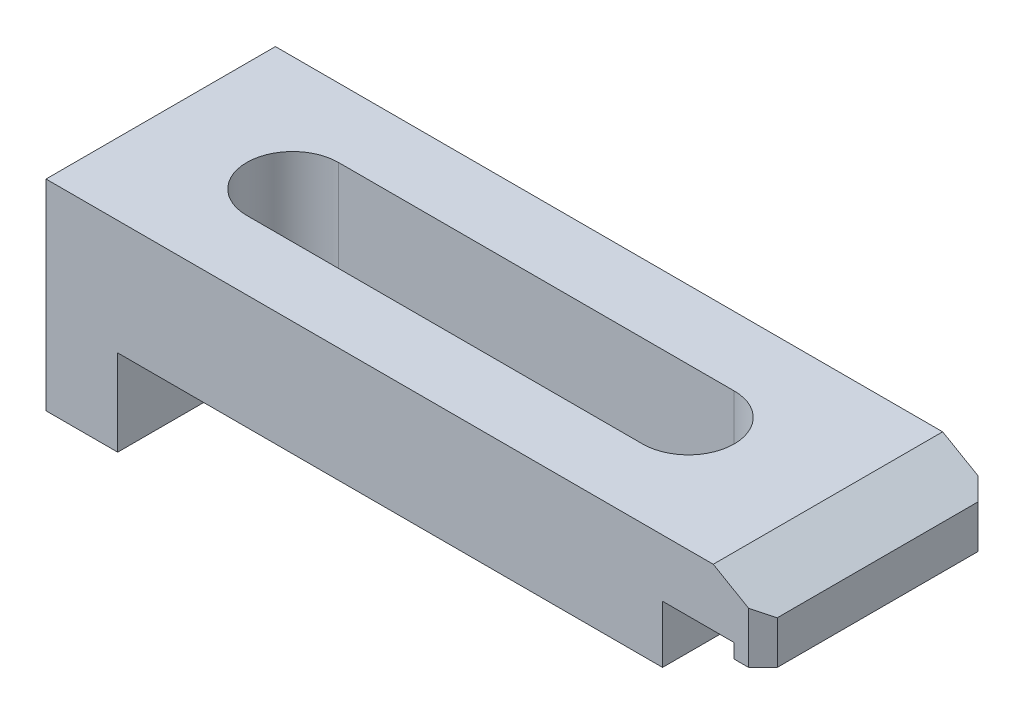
ISO-10303-21;
HEADER;
FILE_DESCRIPTION(('STEP AP214'),'2;1');
FILE_NAME('part.step','',(''),(''),'','','');
FILE_SCHEMA(('AUTOMOTIVE_DESIGN { 1 0 10303 214 1 1 1 1 }'));
ENDSEC;
DATA;
#1=APPLICATION_CONTEXT('core data for automotive mechanical design processes');
#2=APPLICATION_PROTOCOL_DEFINITION('international standard','automotive_design',2000,#1);
#3=PRODUCT_CONTEXT('',#1,'mechanical');
#4=PRODUCT('Part','Part','',(#3));
#5=PRODUCT_RELATED_PRODUCT_CATEGORY('part','',(#4));
#6=PRODUCT_DEFINITION_FORMATION('','',#4);
#7=PRODUCT_DEFINITION_CONTEXT('part definition',#1,'design');
#8=PRODUCT_DEFINITION('design','',#6,#7);
#9=PRODUCT_DEFINITION_SHAPE('','',#8);
#10=(LENGTH_UNIT() NAMED_UNIT(*) SI_UNIT(.MILLI.,.METRE.));
#11=(NAMED_UNIT(*) PLANE_ANGLE_UNIT() SI_UNIT($,.RADIAN.));
#12=(NAMED_UNIT(*) SI_UNIT($,.STERADIAN.) SOLID_ANGLE_UNIT());
#13=UNCERTAINTY_MEASURE_WITH_UNIT(LENGTH_MEASURE(1.E-05),#10,'distance_accuracy_value','');
#14=(GEOMETRIC_REPRESENTATION_CONTEXT(3) GLOBAL_UNCERTAINTY_ASSIGNED_CONTEXT((#13)) GLOBAL_UNIT_ASSIGNED_CONTEXT((#10,
#11,#12)) REPRESENTATION_CONTEXT('',''));
#15=CARTESIAN_POINT('',(0.,0.,0.));
#16=DIRECTION('',(0.,0.,1.));
#17=DIRECTION('',(1.,0.,0.));
#18=AXIS2_PLACEMENT_3D('',#15,#16,#17);
#19=CARTESIAN_POINT('',(33.9697190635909,9.00000000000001,0.));
#20=DIRECTION('',(0.,-1.,0.));
#21=DIRECTION('',(0.,0.,-1.));
#22=AXIS2_PLACEMENT_3D('',#19,#20,#21);
#23=PLANE('',#22);
#24=DIRECTION('',(0.,0.,1.));
#25=VECTOR('',#24,1.);
#26=CARTESIAN_POINT('',(31.9697190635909,9.00000000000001,0.));
#27=LINE('',#26,#25);
#28=CARTESIAN_POINT('',(31.9697190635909,9.00000000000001,0.));
#29=VERTEX_POINT('',#28);
#30=CARTESIAN_POINT('',(31.9697190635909,9.00000000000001,16.));
#31=VERTEX_POINT('',#30);
#32=EDGE_CURVE('E303',#29,#31,#27,.T.);
#33=ORIENTED_EDGE('',*,*,#32,.F.);
#34=DIRECTION('',(1.,0.,0.));
#35=VECTOR('',#34,1.);
#36=CARTESIAN_POINT('',(33.9697190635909,9.00000000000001,0.));
#37=LINE('',#36,#35);
#38=CARTESIAN_POINT('',(32.9697190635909,9.00000000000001,0.));
#39=VERTEX_POINT('',#38);
#40=EDGE_CURVE('E300',#29,#39,#37,.T.);
#41=ORIENTED_EDGE('',*,*,#40,.T.);
#42=DIRECTION('',(0.707106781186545,0.,0.70710678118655));
#43=VECTOR('',#42,1.);
#44=CARTESIAN_POINT('',(32.9697190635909,9.00000000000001,0.));
#45=LINE('',#44,#43);
#46=CARTESIAN_POINT('',(33.9697190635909,9.00000000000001,1.));
#47=VERTEX_POINT('',#46);
#48=EDGE_CURVE('E81',#39,#47,#45,.T.);
#49=ORIENTED_EDGE('',*,*,#48,.T.);
#50=DIRECTION('',(0.,0.,-1.));
#51=VECTOR('',#50,1.);
#52=CARTESIAN_POINT('',(33.9697190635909,9.00000000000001,0.));
#53=LINE('',#52,#51);
#54=CARTESIAN_POINT('',(33.9697190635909,9.00000000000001,15.));
#55=VERTEX_POINT('',#54);
#56=EDGE_CURVE('E262',#55,#47,#53,.T.);
#57=ORIENTED_EDGE('',*,*,#56,.F.);
#58=DIRECTION('',(0.707106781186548,0.,-0.707106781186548));
#59=VECTOR('',#58,1.);
#60=CARTESIAN_POINT('',(33.4697190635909,9.00000000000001,15.5));
#61=LINE('',#60,#59);
#62=CARTESIAN_POINT('',(32.9697190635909,9.00000000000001,16.));
#63=VERTEX_POINT('',#62);
#64=EDGE_CURVE('E305',#63,#55,#61,.T.);
#65=ORIENTED_EDGE('',*,*,#64,.F.);
#66=DIRECTION('',(1.,0.,0.));
#67=VECTOR('',#66,1.);
#68=CARTESIAN_POINT('',(33.9697190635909,9.00000000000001,16.));
#69=LINE('',#68,#67);
#70=EDGE_CURVE('E294',#63,#31,#69,.F.);
#71=ORIENTED_EDGE('',*,*,#70,.T.);
#72=EDGE_LOOP('',(#33,#41,#49,#57,#65,#71));
#73=FACE_BOUND('',#72,.T.);
#74=ADVANCED_FACE('F16',(#73),#23,.T.);
#75=CARTESIAN_POINT('',(31.9697190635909,9.00000000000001,0.));
#76=DIRECTION('',(-1.,0.,0.));
#77=DIRECTION('',(0.,0.,1.));
#78=AXIS2_PLACEMENT_3D('',#75,#76,#77);
#79=PLANE('',#78);
#80=DIRECTION('',(0.,1.,0.));
#81=VECTOR('',#80,1.);
#82=CARTESIAN_POINT('',(31.9697190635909,9.00000000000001,0.));
#83=LINE('',#82,#81);
#84=CARTESIAN_POINT('',(31.9697190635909,10.,0.));
#85=VERTEX_POINT('',#84);
#86=EDGE_CURVE('E299',#85,#29,#83,.F.);
#87=ORIENTED_EDGE('',*,*,#86,.T.);
#88=ORIENTED_EDGE('',*,*,#32,.T.);
#89=DIRECTION('',(0.,1.,0.));
#90=VECTOR('',#89,1.);
#91=CARTESIAN_POINT('',(31.9697190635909,9.00000000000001,16.));
#92=LINE('',#91,#90);
#93=CARTESIAN_POINT('',(31.9697190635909,10.,16.));
#94=VERTEX_POINT('',#93);
#95=EDGE_CURVE('E291',#31,#94,#92,.T.);
#96=ORIENTED_EDGE('',*,*,#95,.T.);
#97=DIRECTION('',(0.,0.,1.));
#98=VECTOR('',#97,1.);
#99=CARTESIAN_POINT('',(31.9697190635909,10.,0.));
#100=LINE('',#99,#98);
#101=EDGE_CURVE('E277',#85,#94,#100,.T.);
#102=ORIENTED_EDGE('',*,*,#101,.F.);
#103=EDGE_LOOP('',(#87,#88,#96,#102));
#104=FACE_BOUND('',#103,.T.);
#105=ADVANCED_FACE('F308',(#104),#79,.T.);
#106=CARTESIAN_POINT('',(33.4697190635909,10.6232320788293,15.5));
#107=DIRECTION('',(0.707106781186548,0.,0.707106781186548));
#108=DIRECTION('',(0.707106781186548,0.,-0.707106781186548));
#109=AXIS2_PLACEMENT_3D('',#106,#107,#108);
#110=PLANE('',#109);
#111=DIRECTION('',(-0.654653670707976,0.377964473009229,0.654653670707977));
#112=VECTOR('',#111,1.);
#113=CARTESIAN_POINT('',(33.9697190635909,12.,15.));
#114=LINE('',#113,#112);
#115=CARTESIAN_POINT('',(33.9697190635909,12.,15.));
#116=VERTEX_POINT('',#115);
#117=CARTESIAN_POINT('',(32.9697190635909,12.5773502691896,16.));
#118=VERTEX_POINT('',#117);
#119=EDGE_CURVE('E310',#116,#118,#114,.T.);
#120=ORIENTED_EDGE('',*,*,#119,.T.);
#121=DIRECTION('',(0.,1.,0.));
#122=VECTOR('',#121,1.);
#123=CARTESIAN_POINT('',(32.9697190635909,9.24646415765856,16.));
#124=LINE('',#123,#122);
#125=EDGE_CURVE('E149',#63,#118,#124,.T.);
#126=ORIENTED_EDGE('',*,*,#125,.F.);
#127=ORIENTED_EDGE('',*,*,#64,.T.);
#128=DIRECTION('',(0.,1.,0.));
#129=VECTOR('',#128,1.);
#130=CARTESIAN_POINT('',(33.9697190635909,12.,15.));
#131=LINE('',#130,#129);
#132=EDGE_CURVE('E315',#116,#55,#131,.F.);
#133=ORIENTED_EDGE('',*,*,#132,.F.);
#134=EDGE_LOOP('',(#120,#126,#127,#133));
#135=FACE_BOUND('',#134,.T.);
#136=ADVANCED_FACE('F323',(#135),#110,.T.);
#137=CARTESIAN_POINT('',(33.9697190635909,12.,0.));
#138=DIRECTION('',(1.,0.,0.));
#139=DIRECTION('',(0.,0.,-1.));
#140=AXIS2_PLACEMENT_3D('',#137,#138,#139);
#141=PLANE('',#140);
#142=ORIENTED_EDGE('',*,*,#132,.T.);
#143=ORIENTED_EDGE('',*,*,#56,.T.);
#144=DIRECTION('',(0.,1.,0.));
#145=VECTOR('',#144,1.);
#146=CARTESIAN_POINT('',(33.9697190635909,10.6232320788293,0.999999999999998));
#147=LINE('',#146,#145);
#148=CARTESIAN_POINT('',(33.9697190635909,12.,0.999999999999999));
#149=VERTEX_POINT('',#148);
#150=EDGE_CURVE('E279',#149,#47,#147,.F.);
#151=ORIENTED_EDGE('',*,*,#150,.F.);
#152=DIRECTION('',(0.,0.,1.));
#153=VECTOR('',#152,1.);
#154=CARTESIAN_POINT('',(33.9697190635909,12.,0.));
#155=LINE('',#154,#153);
#156=EDGE_CURVE('E230',#116,#149,#155,.F.);
#157=ORIENTED_EDGE('',*,*,#156,.F.);
#158=EDGE_LOOP('',(#142,#143,#151,#157));
#159=FACE_BOUND('',#158,.T.);
#160=ADVANCED_FACE('F321',(#159),#141,.T.);
#161=CARTESIAN_POINT('',(-11.0302809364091,6.,0.));
#162=DIRECTION('',(1.,0.,0.));
#163=DIRECTION('',(0.,1.,0.));
#164=AXIS2_PLACEMENT_3D('',#161,#162,#163);
#165=PLANE('',#164);
#166=DIRECTION('',(0.,1.,0.));
#167=VECTOR('',#166,1.);
#168=CARTESIAN_POINT('',(-11.0302809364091,9.24646415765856,0.));
#169=LINE('',#168,#167);
#170=CARTESIAN_POINT('',(-11.0302809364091,0.,0.));
#171=VERTEX_POINT('',#170);
#172=CARTESIAN_POINT('',(-11.0302809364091,6.,0.));
#173=VERTEX_POINT('',#172);
#174=EDGE_CURVE('E231',#171,#173,#169,.T.);
#175=ORIENTED_EDGE('',*,*,#174,.T.);
#176=DIRECTION('',(0.,0.,1.));
#177=VECTOR('',#176,1.);
#178=CARTESIAN_POINT('',(-11.0302809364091,6.,0.));
#179=LINE('',#178,#177);
#180=CARTESIAN_POINT('',(-11.0302809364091,6.,16.));
#181=VERTEX_POINT('',#180);
#182=EDGE_CURVE('E254',#181,#173,#179,.F.);
#183=ORIENTED_EDGE('',*,*,#182,.F.);
#184=DIRECTION('',(0.,1.,0.));
#185=VECTOR('',#184,1.);
#186=CARTESIAN_POINT('',(-11.0302809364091,9.24646415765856,16.));
#187=LINE('',#186,#185);
#188=CARTESIAN_POINT('',(-11.0302809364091,0.,16.));
#189=VERTEX_POINT('',#188);
#190=EDGE_CURVE('E148',#189,#181,#187,.T.);
#191=ORIENTED_EDGE('',*,*,#190,.F.);
#192=DIRECTION('',(0.,0.,1.));
#193=VECTOR('',#192,1.);
#194=CARTESIAN_POINT('',(-11.0302809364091,0.,0.));
#195=LINE('',#194,#193);
#196=EDGE_CURVE('E144',#171,#189,#195,.T.);
#197=ORIENTED_EDGE('',*,*,#196,.F.);
#198=EDGE_LOOP('',(#175,#183,#191,#197));
#199=FACE_BOUND('',#198,.T.);
#200=ADVANCED_FACE('F253',(#199),#165,.T.);
#201=CARTESIAN_POINT('',(26.9697190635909,6.00000000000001,0.));
#202=DIRECTION('',(0.,-1.,0.));
#203=DIRECTION('',(1.,0.,0.));
#204=AXIS2_PLACEMENT_3D('',#201,#202,#203);
#205=PLANE('',#204);
#206=DIRECTION('',(1.,0.,0.));
#207=VECTOR('',#206,1.);
#208=CARTESIAN_POINT('',(6.73275065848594,6.,0.));
#209=LINE('',#208,#207);
#210=CARTESIAN_POINT('',(26.9697190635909,6.,0.));
#211=VERTEX_POINT('',#210);
#212=EDGE_CURVE('E249',#173,#211,#209,.T.);
#213=ORIENTED_EDGE('',*,*,#212,.T.);
#214=DIRECTION('',(0.,0.,-1.));
#215=VECTOR('',#214,1.);
#216=CARTESIAN_POINT('',(26.9697190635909,6.00000000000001,0.));
#217=LINE('',#216,#215);
#218=CARTESIAN_POINT('',(26.9697190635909,6.,16.));
#219=VERTEX_POINT('',#218);
#220=EDGE_CURVE('E261',#219,#211,#217,.T.);
#221=ORIENTED_EDGE('',*,*,#220,.F.);
#222=DIRECTION('',(1.,0.,0.));
#223=VECTOR('',#222,1.);
#224=CARTESIAN_POINT('',(6.73275065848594,6.,16.));
#225=LINE('',#224,#223);
#226=EDGE_CURVE('E260',#181,#219,#225,.T.);
#227=ORIENTED_EDGE('',*,*,#226,.F.);
#228=ORIENTED_EDGE('',*,*,#182,.T.);
#229=EDGE_LOOP('',(#213,#221,#227,#228));
#230=FACE_BOUND('',#229,.T.);
#231=CARTESIAN_POINT('',(20.7697190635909,6.00000000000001,8.00000000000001));
#232=DIRECTION('',(0.,-1.,0.));
#233=DIRECTION('',(0.,0.,-1.));
#234=AXIS2_PLACEMENT_3D('',#231,#232,#233);
#235=CIRCLE('',#234,3.2);
#236=CARTESIAN_POINT('',(20.7697190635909,6.,11.2));
#237=VERTEX_POINT('',#236);
#238=CARTESIAN_POINT('',(20.7697190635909,6.00000000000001,4.80000000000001));
#239=VERTEX_POINT('',#238);
#240=EDGE_CURVE('E186',#237,#239,#235,.F.);
#241=ORIENTED_EDGE('',*,*,#240,.T.);
#242=DIRECTION('',(-1.,0.,0.));
#243=VECTOR('',#242,1.);
#244=CARTESIAN_POINT('',(20.7697190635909,6.00000000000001,4.80000000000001));
#245=LINE('',#244,#243);
#246=CARTESIAN_POINT('',(-6.8302809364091,6.,4.80000000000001));
#247=VERTEX_POINT('',#246);
#248=EDGE_CURVE('E191',#239,#247,#245,.T.);
#249=ORIENTED_EDGE('',*,*,#248,.T.);
#250=CARTESIAN_POINT('',(-6.8302809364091,6.,8.00000000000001));
#251=DIRECTION('',(0.,-1.,0.));
#252=DIRECTION('',(0.,0.,-1.));
#253=AXIS2_PLACEMENT_3D('',#250,#251,#252);
#254=CIRCLE('',#253,3.19999999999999);
#255=CARTESIAN_POINT('',(-6.8302809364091,6.,11.2));
#256=VERTEX_POINT('',#255);
#257=EDGE_CURVE('E20',#247,#256,#254,.F.);
#258=ORIENTED_EDGE('',*,*,#257,.T.);
#259=DIRECTION('',(1.,0.,0.));
#260=VECTOR('',#259,1.);
#261=CARTESIAN_POINT('',(-6.8302809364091,6.,11.2));
#262=LINE('',#261,#260);
#263=EDGE_CURVE('E188',#256,#237,#262,.T.);
#264=ORIENTED_EDGE('',*,*,#263,.T.);
#265=EDGE_LOOP('',(#241,#249,#258,#264));
#266=FACE_BOUND('',#265,.T.);
#267=ADVANCED_FACE('F201',(#230,#266),#205,.T.);
#268=CARTESIAN_POINT('',(26.9697190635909,10.,0.));
#269=DIRECTION('',(1.,0.,0.));
#270=DIRECTION('',(0.,0.,-1.));
#271=AXIS2_PLACEMENT_3D('',#268,#269,#270);
#272=PLANE('',#271);
#273=DIRECTION('',(0.,1.,0.));
#274=VECTOR('',#273,1.);
#275=CARTESIAN_POINT('',(26.9697190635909,9.24646415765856,0.));
#276=LINE('',#275,#274);
#277=CARTESIAN_POINT('',(26.9697190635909,10.,0.));
#278=VERTEX_POINT('',#277);
#279=EDGE_CURVE('E247',#211,#278,#276,.T.);
#280=ORIENTED_EDGE('',*,*,#279,.T.);
#281=DIRECTION('',(0.,0.,1.));
#282=VECTOR('',#281,1.);
#283=CARTESIAN_POINT('',(26.9697190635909,10.,0.));
#284=LINE('',#283,#282);
#285=CARTESIAN_POINT('',(26.9697190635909,10.,16.));
#286=VERTEX_POINT('',#285);
#287=EDGE_CURVE('E270',#286,#278,#284,.F.);
#288=ORIENTED_EDGE('',*,*,#287,.F.);
#289=DIRECTION('',(0.,1.,0.));
#290=VECTOR('',#289,1.);
#291=CARTESIAN_POINT('',(26.9697190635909,9.24646415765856,16.));
#292=LINE('',#291,#290);
#293=EDGE_CURVE('E287',#219,#286,#292,.T.);
#294=ORIENTED_EDGE('',*,*,#293,.F.);
#295=ORIENTED_EDGE('',*,*,#220,.T.);
#296=EDGE_LOOP('',(#280,#288,#294,#295));
#297=FACE_BOUND('',#296,.T.);
#298=ADVANCED_FACE('F268',(#297),#272,.T.);
#299=CARTESIAN_POINT('',(31.9697190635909,10.,0.));
#300=DIRECTION('',(0.,-1.,0.));
#301=DIRECTION('',(1.,0.,0.));
#302=AXIS2_PLACEMENT_3D('',#299,#300,#301);
#303=PLANE('',#302);
#304=DIRECTION('',(1.,0.,0.));
#305=VECTOR('',#304,1.);
#306=CARTESIAN_POINT('',(6.73275065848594,10.,0.));
#307=LINE('',#306,#305);
#308=EDGE_CURVE('E244',#278,#85,#307,.T.);
#309=ORIENTED_EDGE('',*,*,#308,.T.);
#310=ORIENTED_EDGE('',*,*,#101,.T.);
#311=DIRECTION('',(1.,0.,0.));
#312=VECTOR('',#311,1.);
#313=CARTESIAN_POINT('',(6.73275065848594,10.,16.));
#314=LINE('',#313,#312);
#315=EDGE_CURVE('E242',#286,#94,#314,.T.);
#316=ORIENTED_EDGE('',*,*,#315,.F.);
#317=ORIENTED_EDGE('',*,*,#287,.T.);
#318=EDGE_LOOP('',(#309,#310,#316,#317));
#319=FACE_BOUND('',#318,.T.);
#320=ADVANCED_FACE('F273',(#319),#303,.T.);
#321=CARTESIAN_POINT('',(33.4697190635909,10.6232320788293,0.5));
#322=DIRECTION('',(0.707106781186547,0.,-0.707106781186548));
#323=DIRECTION('',(-0.707106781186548,0.,-0.707106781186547));
#324=AXIS2_PLACEMENT_3D('',#321,#322,#323);
#325=PLANE('',#324);
#326=DIRECTION('',(-0.654653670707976,0.377964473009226,-0.65465367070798));
#327=VECTOR('',#326,1.);
#328=CARTESIAN_POINT('',(33.9697190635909,12.,1.));
#329=LINE('',#328,#327);
#330=CARTESIAN_POINT('',(32.9697190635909,12.5773502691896,0.));
#331=VERTEX_POINT('',#330);
#332=EDGE_CURVE('E237',#149,#331,#329,.T.);
#333=ORIENTED_EDGE('',*,*,#332,.F.);
#334=ORIENTED_EDGE('',*,*,#150,.T.);
#335=ORIENTED_EDGE('',*,*,#48,.F.);
#336=DIRECTION('',(0.,1.,0.));
#337=VECTOR('',#336,1.);
#338=CARTESIAN_POINT('',(32.9697190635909,9.24646415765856,0.));
#339=LINE('',#338,#337);
#340=EDGE_CURVE('E158',#39,#331,#339,.T.);
#341=ORIENTED_EDGE('',*,*,#340,.T.);
#342=EDGE_LOOP('',(#333,#334,#335,#341));
#343=FACE_BOUND('',#342,.T.);
#344=ADVANCED_FACE('F343',(#343),#325,.T.);
#345=CARTESIAN_POINT('',(-11.0302809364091,0.,0.));
#346=DIRECTION('',(0.,-1.,0.));
#347=DIRECTION('',(1.,0.,0.));
#348=AXIS2_PLACEMENT_3D('',#345,#346,#347);
#349=PLANE('',#348);
#350=DIRECTION('',(1.,0.,0.));
#351=VECTOR('',#350,1.);
#352=CARTESIAN_POINT('',(6.73275065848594,0.,0.));
#353=LINE('',#352,#351);
#354=CARTESIAN_POINT('',(-16.0302809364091,0.,0.));
#355=VERTEX_POINT('',#354);
#356=EDGE_CURVE('E134',#355,#171,#353,.T.);
#357=ORIENTED_EDGE('',*,*,#356,.T.);
#358=ORIENTED_EDGE('',*,*,#196,.T.);
#359=DIRECTION('',(1.,0.,0.));
#360=VECTOR('',#359,1.);
#361=CARTESIAN_POINT('',(6.73275065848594,0.,16.));
#362=LINE('',#361,#360);
#363=CARTESIAN_POINT('',(-16.0302809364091,0.,16.));
#364=VERTEX_POINT('',#363);
#365=EDGE_CURVE('E139',#364,#189,#362,.T.);
#366=ORIENTED_EDGE('',*,*,#365,.F.);
#367=DIRECTION('',(0.,0.,1.));
#368=VECTOR('',#367,1.);
#369=CARTESIAN_POINT('',(-16.0302809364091,0.,0.));
#370=LINE('',#369,#368);
#371=EDGE_CURVE('E143',#355,#364,#370,.T.);
#372=ORIENTED_EDGE('',*,*,#371,.F.);
#373=EDGE_LOOP('',(#357,#358,#366,#372));
#374=FACE_BOUND('',#373,.T.);
#375=ADVANCED_FACE('F141',(#374),#349,.T.);
#376=CARTESIAN_POINT('',(-6.8302809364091,14.,8.00000000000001));
#377=DIRECTION('',(0.,-1.,0.));
#378=DIRECTION('',(0.,0.,-1.));
#379=AXIS2_PLACEMENT_3D('',#376,#377,#378);
#380=CYLINDRICAL_SURFACE('',#379,3.19999999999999);
#381=DIRECTION('',(0.,1.,0.));
#382=VECTOR('',#381,1.);
#383=CARTESIAN_POINT('',(-6.8302809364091,14.,4.80000000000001));
#384=LINE('',#383,#382);
#385=CARTESIAN_POINT('',(-6.8302809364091,14.,4.80000000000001));
#386=VERTEX_POINT('',#385);
#387=EDGE_CURVE('E192',#247,#386,#384,.T.);
#388=ORIENTED_EDGE('',*,*,#387,.T.);
#389=CARTESIAN_POINT('',(-6.8302809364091,14.,8.00000000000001));
#390=DIRECTION('',(0.,-1.,0.));
#391=DIRECTION('',(0.,0.,-1.));
#392=AXIS2_PLACEMENT_3D('',#389,#390,#391);
#393=CIRCLE('',#392,3.19999999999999);
#394=CARTESIAN_POINT('',(-6.8302809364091,14.,11.2));
#395=VERTEX_POINT('',#394);
#396=EDGE_CURVE('E161',#395,#386,#393,.T.);
#397=ORIENTED_EDGE('',*,*,#396,.F.);
#398=DIRECTION('',(0.,-1.,0.));
#399=VECTOR('',#398,1.);
#400=CARTESIAN_POINT('',(-6.8302809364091,14.,11.2));
#401=LINE('',#400,#399);
#402=EDGE_CURVE('E185',#395,#256,#401,.T.);
#403=ORIENTED_EDGE('',*,*,#402,.T.);
#404=ORIENTED_EDGE('',*,*,#257,.F.);
#405=EDGE_LOOP('',(#388,#397,#403,#404));
#406=FACE_BOUND('',#405,.T.);
#407=ADVANCED_FACE('F211',(#406),#380,.F.);
#408=CARTESIAN_POINT('',(20.7697190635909,14.,4.80000000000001));
#409=DIRECTION('',(0.,0.,-1.));
#410=DIRECTION('',(-1.,0.,0.));
#411=AXIS2_PLACEMENT_3D('',#408,#409,#410);
#412=PLANE('',#411);
#413=DIRECTION('',(0.,-1.,0.));
#414=VECTOR('',#413,1.);
#415=CARTESIAN_POINT('',(20.7697190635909,14.,4.8));
#416=LINE('',#415,#414);
#417=CARTESIAN_POINT('',(20.7697190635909,14.,4.80000000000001));
#418=VERTEX_POINT('',#417);
#419=EDGE_CURVE('E189',#239,#418,#416,.F.);
#420=ORIENTED_EDGE('',*,*,#419,.T.);
#421=DIRECTION('',(1.,0.,0.));
#422=VECTOR('',#421,1.);
#423=CARTESIAN_POINT('',(-16.0302809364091,14.,4.80000000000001));
#424=LINE('',#423,#422);
#425=EDGE_CURVE('E164',#386,#418,#424,.T.);
#426=ORIENTED_EDGE('',*,*,#425,.F.);
#427=ORIENTED_EDGE('',*,*,#387,.F.);
#428=ORIENTED_EDGE('',*,*,#248,.F.);
#429=EDGE_LOOP('',(#420,#426,#427,#428));
#430=FACE_BOUND('',#429,.T.);
#431=ADVANCED_FACE('F210',(#430),#412,.F.);
#432=CARTESIAN_POINT('',(20.7697190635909,14.,8.00000000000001));
#433=DIRECTION('',(0.,-1.,0.));
#434=DIRECTION('',(0.,0.,-1.));
#435=AXIS2_PLACEMENT_3D('',#432,#433,#434);
#436=CYLINDRICAL_SURFACE('',#435,3.2);
#437=DIRECTION('',(0.,-1.,0.));
#438=VECTOR('',#437,1.);
#439=CARTESIAN_POINT('',(20.7697190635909,14.,11.2));
#440=LINE('',#439,#438);
#441=CARTESIAN_POINT('',(20.7697190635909,14.,11.2));
#442=VERTEX_POINT('',#441);
#443=EDGE_CURVE('E183',#237,#442,#440,.F.);
#444=ORIENTED_EDGE('',*,*,#443,.T.);
#445=CARTESIAN_POINT('',(20.7697190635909,14.,8.00000000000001));
#446=DIRECTION('',(0.,-1.,0.));
#447=DIRECTION('',(0.,0.,-1.));
#448=AXIS2_PLACEMENT_3D('',#445,#446,#447);
#449=CIRCLE('',#448,3.2);
#450=EDGE_CURVE('E180',#418,#442,#449,.T.);
#451=ORIENTED_EDGE('',*,*,#450,.F.);
#452=ORIENTED_EDGE('',*,*,#419,.F.);
#453=ORIENTED_EDGE('',*,*,#240,.F.);
#454=EDGE_LOOP('',(#444,#451,#452,#453));
#455=FACE_BOUND('',#454,.T.);
#456=ADVANCED_FACE('F207',(#455),#436,.F.);
#457=CARTESIAN_POINT('',(-6.8302809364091,14.,11.2));
#458=DIRECTION('',(0.,0.,1.));
#459=DIRECTION('',(0.,-1.,0.));
#460=AXIS2_PLACEMENT_3D('',#457,#458,#459);
#461=PLANE('',#460);
#462=ORIENTED_EDGE('',*,*,#402,.F.);
#463=DIRECTION('',(1.,0.,0.));
#464=VECTOR('',#463,1.);
#465=CARTESIAN_POINT('',(-16.0302809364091,14.,11.2));
#466=LINE('',#465,#464);
#467=EDGE_CURVE('E177',#442,#395,#466,.F.);
#468=ORIENTED_EDGE('',*,*,#467,.F.);
#469=ORIENTED_EDGE('',*,*,#443,.F.);
#470=ORIENTED_EDGE('',*,*,#263,.F.);
#471=EDGE_LOOP('',(#462,#468,#469,#470));
#472=FACE_BOUND('',#471,.T.);
#473=ADVANCED_FACE('F216',(#472),#461,.F.);
#474=CARTESIAN_POINT('',(6.73275065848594,9.24646415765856,16.));
#475=DIRECTION('',(0.,0.,1.));
#476=DIRECTION('',(1.,0.,0.));
#477=AXIS2_PLACEMENT_3D('',#474,#475,#476);
#478=PLANE('',#477);
#479=ORIENTED_EDGE('',*,*,#95,.F.);
#480=ORIENTED_EDGE('',*,*,#70,.F.);
#481=ORIENTED_EDGE('',*,*,#125,.T.);
#482=DIRECTION('',(-0.866025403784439,0.499999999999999,0.));
#483=VECTOR('',#482,1.);
#484=CARTESIAN_POINT('',(30.5056174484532,14.,16.));
#485=LINE('',#484,#483);
#486=CARTESIAN_POINT('',(30.5056174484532,14.,16.));
#487=VERTEX_POINT('',#486);
#488=EDGE_CURVE('E233',#487,#118,#485,.F.);
#489=ORIENTED_EDGE('',*,*,#488,.F.);
#490=DIRECTION('',(1.,0.,0.));
#491=VECTOR('',#490,1.);
#492=CARTESIAN_POINT('',(-16.0302809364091,14.,16.));
#493=LINE('',#492,#491);
#494=CARTESIAN_POINT('',(-16.0302809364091,14.,16.));
#495=VERTEX_POINT('',#494);
#496=EDGE_CURVE('E156',#495,#487,#493,.T.);
#497=ORIENTED_EDGE('',*,*,#496,.F.);
#498=DIRECTION('',(0.,1.,0.));
#499=VECTOR('',#498,1.);
#500=CARTESIAN_POINT('',(-16.0302809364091,0.,16.));
#501=LINE('',#500,#499);
#502=EDGE_CURVE('E152',#364,#495,#501,.T.);
#503=ORIENTED_EDGE('',*,*,#502,.F.);
#504=ORIENTED_EDGE('',*,*,#365,.T.);
#505=ORIENTED_EDGE('',*,*,#190,.T.);
#506=ORIENTED_EDGE('',*,*,#226,.T.);
#507=ORIENTED_EDGE('',*,*,#293,.T.);
#508=ORIENTED_EDGE('',*,*,#315,.T.);
#509=EDGE_LOOP('',(#479,#480,#481,#489,#497,#503,#504,#505,#506,#507,#508));
#510=FACE_BOUND('',#509,.T.);
#511=ADVANCED_FACE('F154',(#510),#478,.T.);
#512=CARTESIAN_POINT('',(30.5056174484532,14.,0.));
#513=DIRECTION('',(0.499999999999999,0.866025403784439,0.));
#514=DIRECTION('',(-0.866025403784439,0.499999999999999,0.));
#515=AXIS2_PLACEMENT_3D('',#512,#513,#514);
#516=PLANE('',#515);
#517=ORIENTED_EDGE('',*,*,#119,.F.);
#518=ORIENTED_EDGE('',*,*,#156,.T.);
#519=ORIENTED_EDGE('',*,*,#332,.T.);
#520=DIRECTION('',(-0.86602540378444,0.499999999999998,0.));
#521=VECTOR('',#520,1.);
#522=CARTESIAN_POINT('',(32.9697190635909,12.5773502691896,0.));
#523=LINE('',#522,#521);
#524=CARTESIAN_POINT('',(30.5056174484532,14.,0.));
#525=VERTEX_POINT('',#524);
#526=EDGE_CURVE('E168',#331,#525,#523,.T.);
#527=ORIENTED_EDGE('',*,*,#526,.T.);
#528=DIRECTION('',(0.,0.,1.));
#529=VECTOR('',#528,1.);
#530=CARTESIAN_POINT('',(30.5056174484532,14.,0.));
#531=LINE('',#530,#529);
#532=EDGE_CURVE('E173',#487,#525,#531,.F.);
#533=ORIENTED_EDGE('',*,*,#532,.F.);
#534=ORIENTED_EDGE('',*,*,#488,.T.);
#535=EDGE_LOOP('',(#517,#518,#519,#527,#533,#534));
#536=FACE_BOUND('',#535,.T.);
#537=ADVANCED_FACE('F324',(#536),#516,.T.);
#538=CARTESIAN_POINT('',(6.73275065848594,9.24646415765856,0.));
#539=DIRECTION('',(0.,0.,1.));
#540=DIRECTION('',(1.,0.,0.));
#541=AXIS2_PLACEMENT_3D('',#538,#539,#540);
#542=PLANE('',#541);
#543=ORIENTED_EDGE('',*,*,#40,.F.);
#544=ORIENTED_EDGE('',*,*,#86,.F.);
#545=ORIENTED_EDGE('',*,*,#308,.F.);
#546=ORIENTED_EDGE('',*,*,#279,.F.);
#547=ORIENTED_EDGE('',*,*,#212,.F.);
#548=ORIENTED_EDGE('',*,*,#174,.F.);
#549=ORIENTED_EDGE('',*,*,#356,.F.);
#550=DIRECTION('',(0.,1.,0.));
#551=VECTOR('',#550,1.);
#552=CARTESIAN_POINT('',(-16.0302809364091,0.,0.));
#553=LINE('',#552,#551);
#554=CARTESIAN_POINT('',(-16.0302809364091,14.,0.));
#555=VERTEX_POINT('',#554);
#556=EDGE_CURVE('E35',#555,#355,#553,.F.);
#557=ORIENTED_EDGE('',*,*,#556,.F.);
#558=DIRECTION('',(1.,0.,0.));
#559=VECTOR('',#558,1.);
#560=CARTESIAN_POINT('',(-16.0302809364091,14.,0.));
#561=LINE('',#560,#559);
#562=EDGE_CURVE('E26',#525,#555,#561,.F.);
#563=ORIENTED_EDGE('',*,*,#562,.F.);
#564=ORIENTED_EDGE('',*,*,#526,.F.);
#565=ORIENTED_EDGE('',*,*,#340,.F.);
#566=EDGE_LOOP('',(#543,#544,#545,#546,#547,#548,#549,#557,#563,#564,#565));
#567=FACE_BOUND('',#566,.T.);
#568=ADVANCED_FACE('F222',(#567),#542,.F.);
#569=CARTESIAN_POINT('',(-16.0302809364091,0.,0.));
#570=DIRECTION('',(-1.,0.,0.));
#571=DIRECTION('',(0.,0.,1.));
#572=AXIS2_PLACEMENT_3D('',#569,#570,#571);
#573=PLANE('',#572);
#574=ORIENTED_EDGE('',*,*,#556,.T.);
#575=ORIENTED_EDGE('',*,*,#371,.T.);
#576=ORIENTED_EDGE('',*,*,#502,.T.);
#577=DIRECTION('',(0.,0.,1.));
#578=VECTOR('',#577,1.);
#579=CARTESIAN_POINT('',(-16.0302809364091,14.,0.));
#580=LINE('',#579,#578);
#581=EDGE_CURVE('E10',#555,#495,#580,.T.);
#582=ORIENTED_EDGE('',*,*,#581,.F.);
#583=EDGE_LOOP('',(#574,#575,#576,#582));
#584=FACE_BOUND('',#583,.T.);
#585=ADVANCED_FACE('F160',(#584),#573,.T.);
#586=CARTESIAN_POINT('',(-16.0302809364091,14.,0.));
#587=DIRECTION('',(0.,1.,0.));
#588=DIRECTION('',(0.,0.,1.));
#589=AXIS2_PLACEMENT_3D('',#586,#587,#588);
#590=PLANE('',#589);
#591=ORIENTED_EDGE('',*,*,#562,.T.);
#592=ORIENTED_EDGE('',*,*,#581,.T.);
#593=ORIENTED_EDGE('',*,*,#496,.T.);
#594=ORIENTED_EDGE('',*,*,#532,.T.);
#595=EDGE_LOOP('',(#591,#592,#593,#594));
#596=FACE_BOUND('',#595,.T.);
#597=ORIENTED_EDGE('',*,*,#450,.T.);
#598=ORIENTED_EDGE('',*,*,#467,.T.);
#599=ORIENTED_EDGE('',*,*,#396,.T.);
#600=ORIENTED_EDGE('',*,*,#425,.T.);
#601=EDGE_LOOP('',(#597,#598,#599,#600));
#602=FACE_BOUND('',#601,.T.);
#603=ADVANCED_FACE('F18',(#596,#602),#590,.T.);
#604=CLOSED_SHELL('',(#74,#105,#136,#160,#200,#267,#298,#320,#344,#375,#407,#431,#456,#473,#511,
#537,#568,#585,#603));
#605=MANIFOLD_SOLID_BREP('B1',#604);
#606=ADVANCED_BREP_SHAPE_REPRESENTATION('',(#18,#605),#14);
#607=SHAPE_DEFINITION_REPRESENTATION(#9,#606);
ENDSEC;
END-ISO-10303-21;
